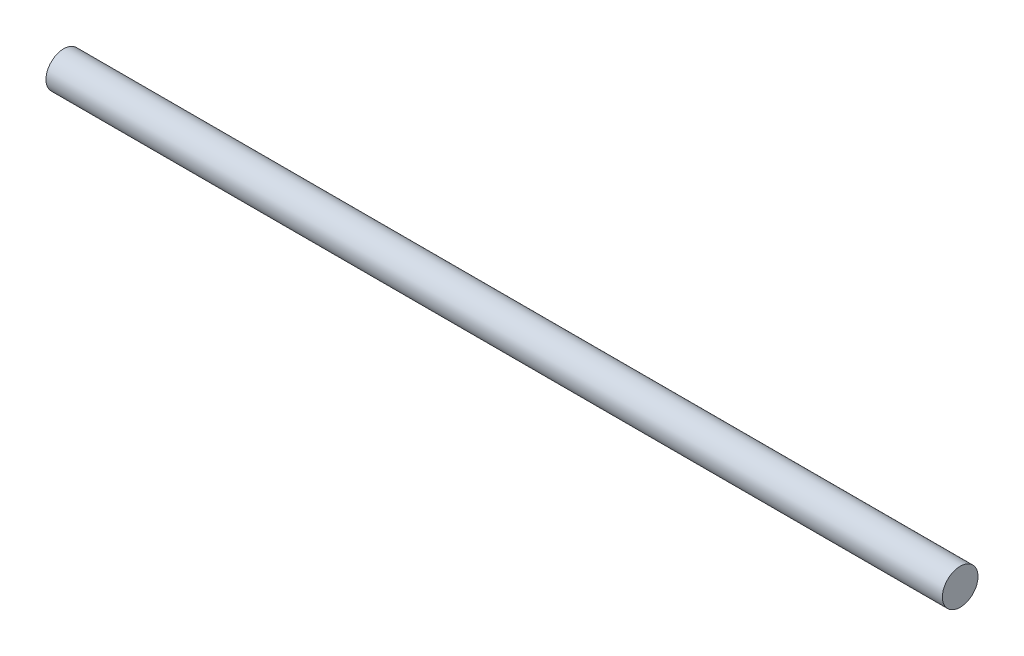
ISO-10303-21;
HEADER;
FILE_DESCRIPTION(('STEP AP214'),'2;1');
FILE_NAME('part.step','',(''),(''),'','','');
FILE_SCHEMA(('AUTOMOTIVE_DESIGN { 1 0 10303 214 1 1 1 1 }'));
ENDSEC;
DATA;
#1=APPLICATION_CONTEXT('core data for automotive mechanical design processes');
#2=APPLICATION_PROTOCOL_DEFINITION('international standard','automotive_design',2000,#1);
#3=PRODUCT_CONTEXT('',#1,'mechanical');
#4=PRODUCT('Part','Part','',(#3));
#5=PRODUCT_RELATED_PRODUCT_CATEGORY('part','',(#4));
#6=PRODUCT_DEFINITION_FORMATION('','',#4);
#7=PRODUCT_DEFINITION_CONTEXT('part definition',#1,'design');
#8=PRODUCT_DEFINITION('design','',#6,#7);
#9=PRODUCT_DEFINITION_SHAPE('','',#8);
#10=(LENGTH_UNIT() NAMED_UNIT(*) SI_UNIT(.MILLI.,.METRE.));
#11=(NAMED_UNIT(*) PLANE_ANGLE_UNIT() SI_UNIT($,.RADIAN.));
#12=(NAMED_UNIT(*) SI_UNIT($,.STERADIAN.) SOLID_ANGLE_UNIT());
#13=UNCERTAINTY_MEASURE_WITH_UNIT(LENGTH_MEASURE(1.E-05),#10,'distance_accuracy_value','');
#14=(GEOMETRIC_REPRESENTATION_CONTEXT(3) GLOBAL_UNCERTAINTY_ASSIGNED_CONTEXT((#13)) GLOBAL_UNIT_ASSIGNED_CONTEXT((#10,
#11,#12)) REPRESENTATION_CONTEXT('',''));
#15=CARTESIAN_POINT('',(0.,0.,0.));
#16=DIRECTION('',(0.,0.,1.));
#17=DIRECTION('',(1.,0.,0.));
#18=AXIS2_PLACEMENT_3D('',#15,#16,#17);
#19=CARTESIAN_POINT('',(151.,0.,0.));
#20=DIRECTION('',(-1.,0.,0.));
#21=DIRECTION('',(0.,0.,1.));
#22=AXIS2_PLACEMENT_3D('',#19,#20,#21);
#23=CYLINDRICAL_SURFACE('',#22,3.);
#24=CARTESIAN_POINT('',(151.,0.,0.));
#25=DIRECTION('',(1.,0.,0.));
#26=DIRECTION('',(0.,0.,-1.));
#27=AXIS2_PLACEMENT_3D('',#24,#25,#26);
#28=CIRCLE('',#27,3.);
#29=CARTESIAN_POINT('',(151.,0.,-3.));
#30=VERTEX_POINT('',#29);
#31=EDGE_CURVE('E10',#30,#30,#28,.T.);
#32=ORIENTED_EDGE('',*,*,#31,.F.);
#33=EDGE_LOOP('',(#32));
#34=FACE_BOUND('',#33,.T.);
#35=CARTESIAN_POINT('',(0.,0.,0.));
#36=DIRECTION('',(1.,0.,0.));
#37=DIRECTION('',(0.,0.,-1.));
#38=AXIS2_PLACEMENT_3D('',#35,#36,#37);
#39=CIRCLE('',#38,3.);
#40=CARTESIAN_POINT('',(0.,0.,-3.));
#41=VERTEX_POINT('',#40);
#42=EDGE_CURVE('E33',#41,#41,#39,.T.);
#43=ORIENTED_EDGE('',*,*,#42,.T.);
#44=EDGE_LOOP('',(#43));
#45=FACE_BOUND('',#44,.T.);
#46=ADVANCED_FACE('F30',(#34,#45),#23,.T.);
#47=CARTESIAN_POINT('',(151.,0.,0.));
#48=DIRECTION('',(1.,0.,0.));
#49=DIRECTION('',(0.,0.,-1.));
#50=AXIS2_PLACEMENT_3D('',#47,#48,#49);
#51=PLANE('',#50);
#52=ORIENTED_EDGE('',*,*,#31,.T.);
#53=EDGE_LOOP('',(#52));
#54=FACE_BOUND('',#53,.T.);
#55=ADVANCED_FACE('F45',(#54),#51,.T.);
#56=CARTESIAN_POINT('',(0.,0.,0.));
#57=DIRECTION('',(1.,0.,0.));
#58=DIRECTION('',(0.,0.,-1.));
#59=AXIS2_PLACEMENT_3D('',#56,#57,#58);
#60=PLANE('',#59);
#61=ORIENTED_EDGE('',*,*,#42,.F.);
#62=EDGE_LOOP('',(#61));
#63=FACE_BOUND('',#62,.T.);
#64=ADVANCED_FACE('F43',(#63),#60,.F.);
#65=CLOSED_SHELL('',(#46,#55,#64));
#66=MANIFOLD_SOLID_BREP('B2',#65);
#67=ADVANCED_BREP_SHAPE_REPRESENTATION('',(#18,#66),#14);
#68=SHAPE_DEFINITION_REPRESENTATION(#9,#67);
ENDSEC;
END-ISO-10303-21;
